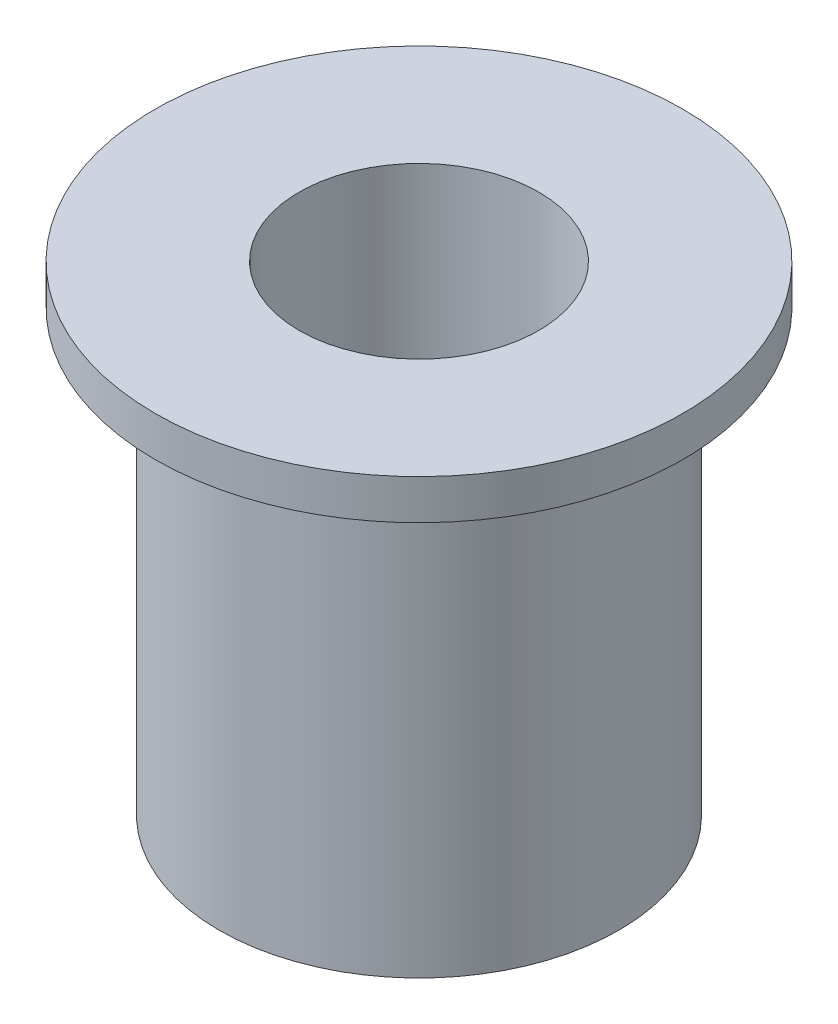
ISO-10303-21;
HEADER;
FILE_DESCRIPTION(('STEP AP214'),'2;1');
FILE_NAME('part.step','',(''),(''),'','','');
FILE_SCHEMA(('AUTOMOTIVE_DESIGN { 1 0 10303 214 1 1 1 1 }'));
ENDSEC;
DATA;
#1=APPLICATION_CONTEXT('core data for automotive mechanical design processes');
#2=APPLICATION_PROTOCOL_DEFINITION('international standard','automotive_design',2000,#1);
#3=PRODUCT_CONTEXT('',#1,'mechanical');
#4=PRODUCT('Part','Part','',(#3));
#5=PRODUCT_RELATED_PRODUCT_CATEGORY('part','',(#4));
#6=PRODUCT_DEFINITION_FORMATION('','',#4);
#7=PRODUCT_DEFINITION_CONTEXT('part definition',#1,'design');
#8=PRODUCT_DEFINITION('design','',#6,#7);
#9=PRODUCT_DEFINITION_SHAPE('','',#8);
#10=(LENGTH_UNIT() NAMED_UNIT(*) SI_UNIT(.MILLI.,.METRE.));
#11=(NAMED_UNIT(*) PLANE_ANGLE_UNIT() SI_UNIT($,.RADIAN.));
#12=(NAMED_UNIT(*) SI_UNIT($,.STERADIAN.) SOLID_ANGLE_UNIT());
#13=UNCERTAINTY_MEASURE_WITH_UNIT(LENGTH_MEASURE(1.E-05),#10,'distance_accuracy_value','');
#14=(GEOMETRIC_REPRESENTATION_CONTEXT(3) GLOBAL_UNCERTAINTY_ASSIGNED_CONTEXT((#13)) GLOBAL_UNIT_ASSIGNED_CONTEXT((#10,
#11,#12)) REPRESENTATION_CONTEXT('',''));
#15=CARTESIAN_POINT('',(0.,0.,0.));
#16=DIRECTION('',(0.,0.,1.));
#17=DIRECTION('',(1.,0.,0.));
#18=AXIS2_PLACEMENT_3D('',#15,#16,#17);
#19=CARTESIAN_POINT('',(0.,0.,0.));
#20=DIRECTION('',(0.,1.,0.));
#21=DIRECTION('',(0.,0.,1.));
#22=AXIS2_PLACEMENT_3D('',#19,#20,#21);
#23=PLANE('',#22);
#24=CARTESIAN_POINT('',(0.,0.,0.));
#25=DIRECTION('',(0.,1.,0.));
#26=DIRECTION('',(0.,0.,1.));
#27=AXIS2_PLACEMENT_3D('',#24,#25,#26);
#28=CIRCLE('',#27,7.9375);
#29=CARTESIAN_POINT('',(0.,0.,7.9375));
#30=VERTEX_POINT('',#29);
#31=EDGE_CURVE('E41',#30,#30,#28,.T.);
#32=ORIENTED_EDGE('',*,*,#31,.F.);
#33=EDGE_LOOP('',(#32));
#34=FACE_BOUND('',#33,.T.);
#35=CARTESIAN_POINT('',(0.,0.,0.));
#36=DIRECTION('',(0.,1.,0.));
#37=DIRECTION('',(0.,0.,1.));
#38=AXIS2_PLACEMENT_3D('',#35,#36,#37);
#39=CIRCLE('',#38,4.7625);
#40=CARTESIAN_POINT('',(0.,0.,4.7625));
#41=VERTEX_POINT('',#40);
#42=EDGE_CURVE('E45',#41,#41,#39,.T.);
#43=ORIENTED_EDGE('',*,*,#42,.T.);
#44=EDGE_LOOP('',(#43));
#45=FACE_BOUND('',#44,.T.);
#46=ADVANCED_FACE('F34',(#34,#45),#23,.F.);
#47=CARTESIAN_POINT('',(0.,17.4625,0.));
#48=DIRECTION('',(0.,-1.,0.));
#49=DIRECTION('',(0.,0.,-1.));
#50=AXIS2_PLACEMENT_3D('',#47,#48,#49);
#51=CYLINDRICAL_SURFACE('',#50,7.9375);
#52=CARTESIAN_POINT('',(0.,17.4625,0.));
#53=DIRECTION('',(0.,1.,0.));
#54=DIRECTION('',(0.,0.,1.));
#55=AXIS2_PLACEMENT_3D('',#52,#53,#54);
#56=CIRCLE('',#55,7.9375);
#57=CARTESIAN_POINT('',(0.,17.4625,7.9375));
#58=VERTEX_POINT('',#57);
#59=EDGE_CURVE('E10',#58,#58,#56,.T.);
#60=ORIENTED_EDGE('',*,*,#59,.F.);
#61=EDGE_LOOP('',(#60));
#62=FACE_BOUND('',#61,.T.);
#63=ORIENTED_EDGE('',*,*,#31,.T.);
#64=EDGE_LOOP('',(#63));
#65=FACE_BOUND('',#64,.T.);
#66=ADVANCED_FACE('F36',(#62,#65),#51,.T.);
#67=CARTESIAN_POINT('',(0.,17.4625,0.));
#68=DIRECTION('',(0.,-1.,0.));
#69=DIRECTION('',(0.,0.,-1.));
#70=AXIS2_PLACEMENT_3D('',#67,#68,#69);
#71=CYLINDRICAL_SURFACE('',#70,4.7625);
#72=ORIENTED_EDGE('',*,*,#42,.F.);
#73=EDGE_LOOP('',(#72));
#74=FACE_BOUND('',#73,.T.);
#75=CARTESIAN_POINT('',(0.,19.05,0.));
#76=DIRECTION('',(0.,1.,0.));
#77=DIRECTION('',(0.,0.,1.));
#78=AXIS2_PLACEMENT_3D('',#75,#76,#77);
#79=CIRCLE('',#78,4.7625);
#80=CARTESIAN_POINT('',(0.,19.05,4.7625));
#81=VERTEX_POINT('',#80);
#82=EDGE_CURVE('E57',#81,#81,#79,.T.);
#83=ORIENTED_EDGE('',*,*,#82,.T.);
#84=EDGE_LOOP('',(#83));
#85=FACE_BOUND('',#84,.T.);
#86=ADVANCED_FACE('F61',(#74,#85),#71,.F.);
#87=CARTESIAN_POINT('',(0.,17.4625,0.));
#88=DIRECTION('',(0.,1.,0.));
#89=DIRECTION('',(0.,0.,1.));
#90=AXIS2_PLACEMENT_3D('',#87,#88,#89);
#91=PLANE('',#90);
#92=CARTESIAN_POINT('',(0.,17.4625,0.));
#93=DIRECTION('',(0.,1.,0.));
#94=DIRECTION('',(0.,0.,1.));
#95=AXIS2_PLACEMENT_3D('',#92,#93,#94);
#96=CIRCLE('',#95,10.4775);
#97=CARTESIAN_POINT('',(0.,17.4625,10.4775));
#98=VERTEX_POINT('',#97);
#99=EDGE_CURVE('E54',#98,#98,#96,.T.);
#100=ORIENTED_EDGE('',*,*,#99,.F.);
#101=EDGE_LOOP('',(#100));
#102=FACE_BOUND('',#101,.T.);
#103=ORIENTED_EDGE('',*,*,#59,.T.);
#104=EDGE_LOOP('',(#103));
#105=FACE_BOUND('',#104,.T.);
#106=ADVANCED_FACE('F66',(#102,#105),#91,.F.);
#107=CARTESIAN_POINT('',(0.,19.05,0.));
#108=DIRECTION('',(0.,1.,0.));
#109=DIRECTION('',(0.,0.,1.));
#110=AXIS2_PLACEMENT_3D('',#107,#108,#109);
#111=PLANE('',#110);
#112=CARTESIAN_POINT('',(0.,19.05,0.));
#113=DIRECTION('',(0.,1.,0.));
#114=DIRECTION('',(0.,0.,1.));
#115=AXIS2_PLACEMENT_3D('',#112,#113,#114);
#116=CIRCLE('',#115,10.4775);
#117=CARTESIAN_POINT('',(0.,19.05,10.4775));
#118=VERTEX_POINT('',#117);
#119=EDGE_CURVE('E49',#118,#118,#116,.T.);
#120=ORIENTED_EDGE('',*,*,#119,.T.);
#121=EDGE_LOOP('',(#120));
#122=FACE_BOUND('',#121,.T.);
#123=ORIENTED_EDGE('',*,*,#82,.F.);
#124=EDGE_LOOP('',(#123));
#125=FACE_BOUND('',#124,.T.);
#126=ADVANCED_FACE('F63',(#122,#125),#111,.T.);
#127=CARTESIAN_POINT('',(0.,19.05,0.));
#128=DIRECTION('',(0.,-1.,0.));
#129=DIRECTION('',(0.,0.,-1.));
#130=AXIS2_PLACEMENT_3D('',#127,#128,#129);
#131=CYLINDRICAL_SURFACE('',#130,10.4775);
#132=ORIENTED_EDGE('',*,*,#119,.F.);
#133=EDGE_LOOP('',(#132));
#134=FACE_BOUND('',#133,.T.);
#135=ORIENTED_EDGE('',*,*,#99,.T.);
#136=EDGE_LOOP('',(#135));
#137=FACE_BOUND('',#136,.T.);
#138=ADVANCED_FACE('F65',(#134,#137),#131,.T.);
#139=CLOSED_SHELL('',(#46,#66,#86,#106,#126,#138));
#140=MANIFOLD_SOLID_BREP('B2',#139);
#141=ADVANCED_BREP_SHAPE_REPRESENTATION('',(#18,#140),#14);
#142=SHAPE_DEFINITION_REPRESENTATION(#9,#141);
ENDSEC;
END-ISO-10303-21;
